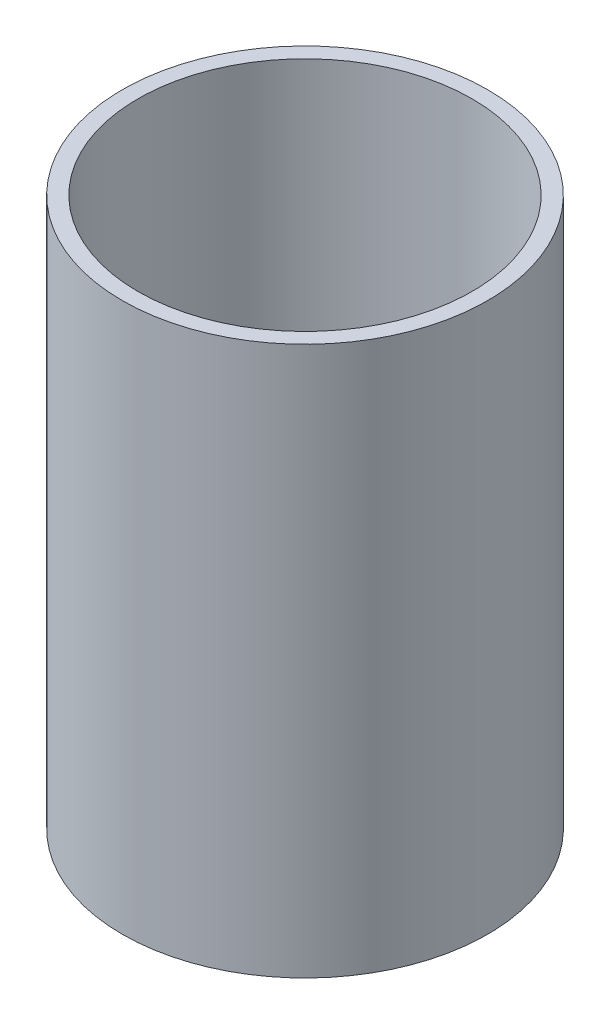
ISO-10303-21;
HEADER;
FILE_DESCRIPTION(('STEP AP214'),'2;1');
FILE_NAME('part.step','',(''),(''),'','','');
FILE_SCHEMA(('AUTOMOTIVE_DESIGN { 1 0 10303 214 1 1 1 1 }'));
ENDSEC;
DATA;
#1=APPLICATION_CONTEXT('core data for automotive mechanical design processes');
#2=APPLICATION_PROTOCOL_DEFINITION('international standard','automotive_design',2000,#1);
#3=PRODUCT_CONTEXT('',#1,'mechanical');
#4=PRODUCT('Part','Part','',(#3));
#5=PRODUCT_RELATED_PRODUCT_CATEGORY('part','',(#4));
#6=PRODUCT_DEFINITION_FORMATION('','',#4);
#7=PRODUCT_DEFINITION_CONTEXT('part definition',#1,'design');
#8=PRODUCT_DEFINITION('design','',#6,#7);
#9=PRODUCT_DEFINITION_SHAPE('','',#8);
#10=(LENGTH_UNIT() NAMED_UNIT(*) SI_UNIT(.MILLI.,.METRE.));
#11=(NAMED_UNIT(*) PLANE_ANGLE_UNIT() SI_UNIT($,.RADIAN.));
#12=(NAMED_UNIT(*) SI_UNIT($,.STERADIAN.) SOLID_ANGLE_UNIT());
#13=UNCERTAINTY_MEASURE_WITH_UNIT(LENGTH_MEASURE(1.E-05),#10,'distance_accuracy_value','');
#14=(GEOMETRIC_REPRESENTATION_CONTEXT(3) GLOBAL_UNCERTAINTY_ASSIGNED_CONTEXT((#13)) GLOBAL_UNIT_ASSIGNED_CONTEXT((#10,
#11,#12)) REPRESENTATION_CONTEXT('',''));
#15=CARTESIAN_POINT('',(0.,0.,0.));
#16=DIRECTION('',(0.,0.,1.));
#17=DIRECTION('',(1.,0.,0.));
#18=AXIS2_PLACEMENT_3D('',#15,#16,#17);
#19=CARTESIAN_POINT('',(27.718012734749,35.,-20.1439926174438));
#20=DIRECTION('',(0.,1.,0.));
#21=DIRECTION('',(0.,0.,1.));
#22=AXIS2_PLACEMENT_3D('',#19,#20,#21);
#23=PLANE('',#22);
#24=CARTESIAN_POINT('',(27.718012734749,35.,-20.1439926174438));
#25=DIRECTION('',(0.,1.,0.));
#26=DIRECTION('',(0.,0.,1.));
#27=AXIS2_PLACEMENT_3D('',#24,#25,#26);
#28=CIRCLE('',#27,11.6500000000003);
#29=CARTESIAN_POINT('',(27.718012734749,35.,-8.49399261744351));
#30=VERTEX_POINT('',#29);
#31=EDGE_CURVE('E12',#30,#30,#28,.T.);
#32=ORIENTED_EDGE('',*,*,#31,.T.);
#33=EDGE_LOOP('',(#32));
#34=FACE_BOUND('',#33,.T.);
#35=CARTESIAN_POINT('',(27.718012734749,35.,-20.1439926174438));
#36=DIRECTION('',(0.,1.,0.));
#37=DIRECTION('',(0.,0.,1.));
#38=AXIS2_PLACEMENT_3D('',#35,#36,#37);
#39=CIRCLE('',#38,10.6500000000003);
#40=CARTESIAN_POINT('',(27.718012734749,35.,-9.4939926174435));
#41=VERTEX_POINT('',#40);
#42=EDGE_CURVE('E57',#41,#41,#39,.T.);
#43=ORIENTED_EDGE('',*,*,#42,.F.);
#44=EDGE_LOOP('',(#43));
#45=FACE_BOUND('',#44,.T.);
#46=ADVANCED_FACE('F46',(#34,#45),#23,.T.);
#47=CARTESIAN_POINT('',(27.718012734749,0.,-20.1439926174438));
#48=DIRECTION('',(0.,1.,0.));
#49=DIRECTION('',(0.,0.,1.));
#50=AXIS2_PLACEMENT_3D('',#47,#48,#49);
#51=PLANE('',#50);
#52=CARTESIAN_POINT('',(27.718012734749,0.,-20.1439926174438));
#53=DIRECTION('',(0.,1.,0.));
#54=DIRECTION('',(0.,0.,1.));
#55=AXIS2_PLACEMENT_3D('',#52,#53,#54);
#56=CIRCLE('',#55,11.6500000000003);
#57=CARTESIAN_POINT('',(27.718012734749,0.,-8.49399261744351));
#58=VERTEX_POINT('',#57);
#59=EDGE_CURVE('E50',#58,#58,#56,.T.);
#60=ORIENTED_EDGE('',*,*,#59,.F.);
#61=EDGE_LOOP('',(#60));
#62=FACE_BOUND('',#61,.T.);
#63=CARTESIAN_POINT('',(27.718012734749,0.,-20.1439926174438));
#64=DIRECTION('',(0.,1.,0.));
#65=DIRECTION('',(0.,0.,1.));
#66=AXIS2_PLACEMENT_3D('',#63,#64,#65);
#67=CIRCLE('',#66,10.6500000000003);
#68=CARTESIAN_POINT('',(27.718012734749,0.,-9.4939926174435));
#69=VERTEX_POINT('',#68);
#70=EDGE_CURVE('E59',#69,#69,#67,.T.);
#71=ORIENTED_EDGE('',*,*,#70,.T.);
#72=EDGE_LOOP('',(#71));
#73=FACE_BOUND('',#72,.T.);
#74=ADVANCED_FACE('F69',(#62,#73),#51,.F.);
#75=CARTESIAN_POINT('',(27.718012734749,35.,-20.1439926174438));
#76=DIRECTION('',(0.,-1.,0.));
#77=DIRECTION('',(0.,0.,-1.));
#78=AXIS2_PLACEMENT_3D('',#75,#76,#77);
#79=CYLINDRICAL_SURFACE('',#78,11.6500000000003);
#80=ORIENTED_EDGE('',*,*,#31,.F.);
#81=EDGE_LOOP('',(#80));
#82=FACE_BOUND('',#81,.T.);
#83=ORIENTED_EDGE('',*,*,#59,.T.);
#84=EDGE_LOOP('',(#83));
#85=FACE_BOUND('',#84,.T.);
#86=ADVANCED_FACE('F48',(#82,#85),#79,.T.);
#87=CARTESIAN_POINT('',(27.718012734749,35.,-20.1439926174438));
#88=DIRECTION('',(0.,-1.,0.));
#89=DIRECTION('',(0.,0.,-1.));
#90=AXIS2_PLACEMENT_3D('',#87,#88,#89);
#91=CYLINDRICAL_SURFACE('',#90,10.6500000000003);
#92=ORIENTED_EDGE('',*,*,#42,.T.);
#93=EDGE_LOOP('',(#92));
#94=FACE_BOUND('',#93,.T.);
#95=ORIENTED_EDGE('',*,*,#70,.F.);
#96=EDGE_LOOP('',(#95));
#97=FACE_BOUND('',#96,.T.);
#98=ADVANCED_FACE('F65',(#94,#97),#91,.F.);
#99=CLOSED_SHELL('',(#46,#74,#86,#98));
#100=MANIFOLD_SOLID_BREP('B2',#99);
#101=ADVANCED_BREP_SHAPE_REPRESENTATION('',(#18,#100),#14);
#102=SHAPE_DEFINITION_REPRESENTATION(#9,#101);
ENDSEC;
END-ISO-10303-21;
